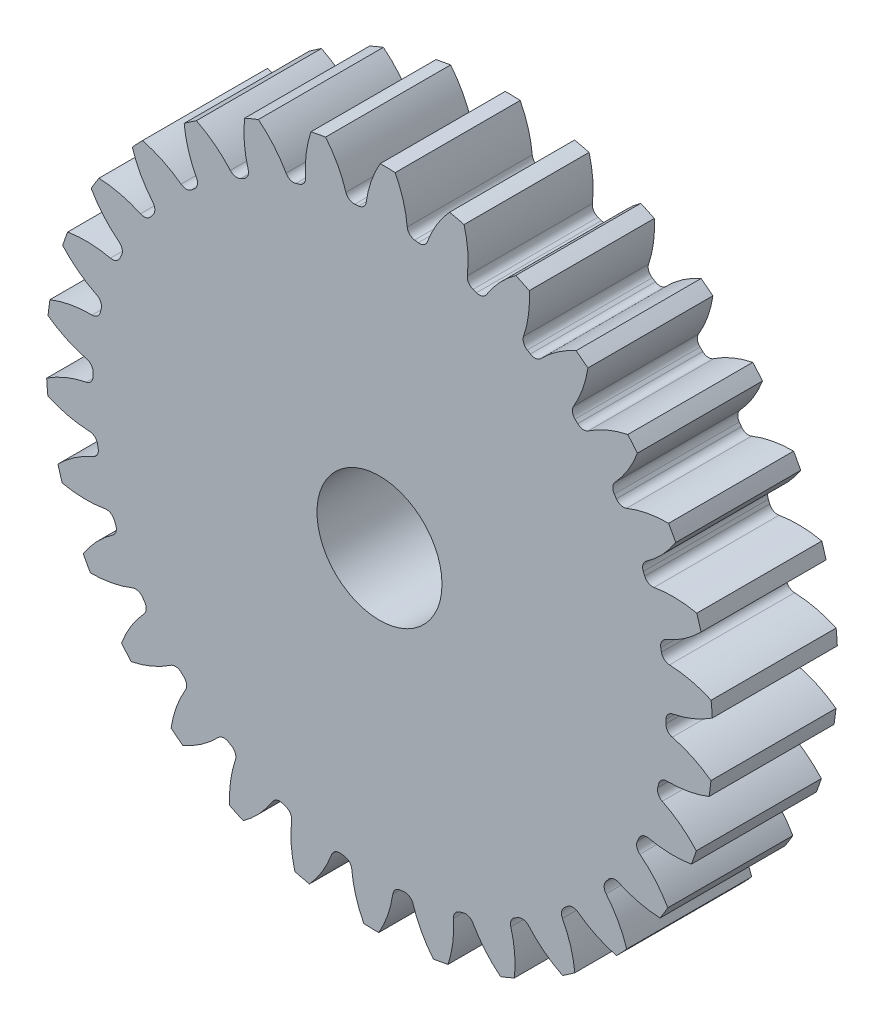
from build123d import *

# Parameters (mm, degrees)
SKETCH3_R         = 270.933333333
GEARBODY_DEPTH    = 101.6
TOOTHCUT_DEPTH    = 397.39917031
CIRPATTERN1_COUNT = 30
BOREDIA_R         = 50.8
BORE_DEPTH        = 12700


with BuildPart() as part:
    # Sketch3 → gearBody (new body)
    with BuildSketch(Plane.XY):
        Circle(SKETCH3_R)
    extrude(amount=GEARBODY_DEPTH)

    # Sketch2 → toothCut (cut, through all)
    with BuildSketch(Plane.XY):
        with BuildLine():
            ThreePointArc((232.720758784, -7.239443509), (232.762525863, -5.74174755), (232.794654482, -4.243813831))
            ThreePointArc((232.794654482, -4.243813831), (234.394977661, 0.047526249), (238.331718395, 2.388189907))
            ThreePointArc((238.331718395, 2.388189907), (255.297189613, 7.55456454), (270.933333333, 15.922936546))
            ThreePointArc((270.933333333, 15.922936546), (271.318294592, -6.692834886), (269.81871585, -29.262118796))
            ThreePointArc((269.81871585, -29.262118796), (254.614197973, -20.132974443), (237.924092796, -14.13638961))
            ThreePointArc((237.924092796, -14.13638961), (234.107548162, -11.604469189), (232.720758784, -7.239443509))
        make_face()
    toothcut = extrude(amount=TOOTHCUT_DEPTH, mode=Mode.SUBTRACT)

    # CirPattern1: toothCut ×30 about axis
    cirpattern1_axis = Axis((0, 0, 0), (0, 0, 1))
    for i in range(1, CIRPATTERN1_COUNT):
        add(toothcut.rotate(cirpattern1_axis, i * 360 / CIRPATTERN1_COUNT), mode=Mode.SUBTRACT)

    # boreDia → bore (cut, symmetric)
    with BuildSketch(Plane.XY):
        Circle(BOREDIA_R)
    extrude(amount=BORE_DEPTH, both=True, mode=Mode.SUBTRACT)


solid = part.part
